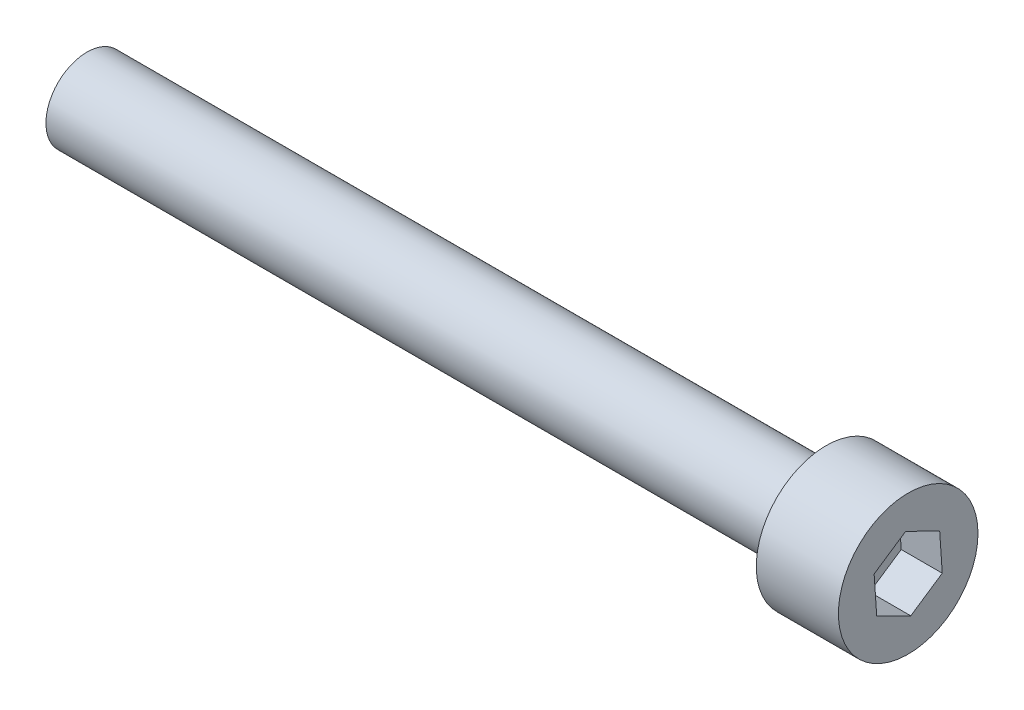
from build123d import *

# Parameters (mm, degrees)
ENL_V_MAT_EXTRU_1_DEPTH = 2.5


with BuildPart() as part:
    # Esquisse1 → R_volution1 (revolve)
    with BuildSketch(Plane.XY, mode=Mode.PRIVATE) as r_volution1_sk:
        Polygon((0, 0), (0, 4.25), (-5, 4.25), (-5, 2.5), (-50, 2.5), (-50, 0), align=None)
    revolve(r_volution1_sk.sketch.rotate(Axis((0, 0, 0), (-1, 0, 0)), 90), axis=Axis((0, 0, 0), (-1, 0, 0)))

    # Esquisse2 → Enl_v. mat.-Extru.1 (cut)
    with BuildSketch(Plane(origin=(0, 0, 0), x_dir=(0, 0, -1), z_dir=(1, 0, 0))):
        Polygon((2.073693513, -1.016429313), (1.917100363, 1.287656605), (-0.15659315, 2.304085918), (-2.073693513, 1.016429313), (-1.917100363, -1.287656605), (0.15659315, -2.304085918), align=None)
    extrude(amount=-ENL_V_MAT_EXTRU_1_DEPTH, mode=Mode.SUBTRACT)


solid = part.part
